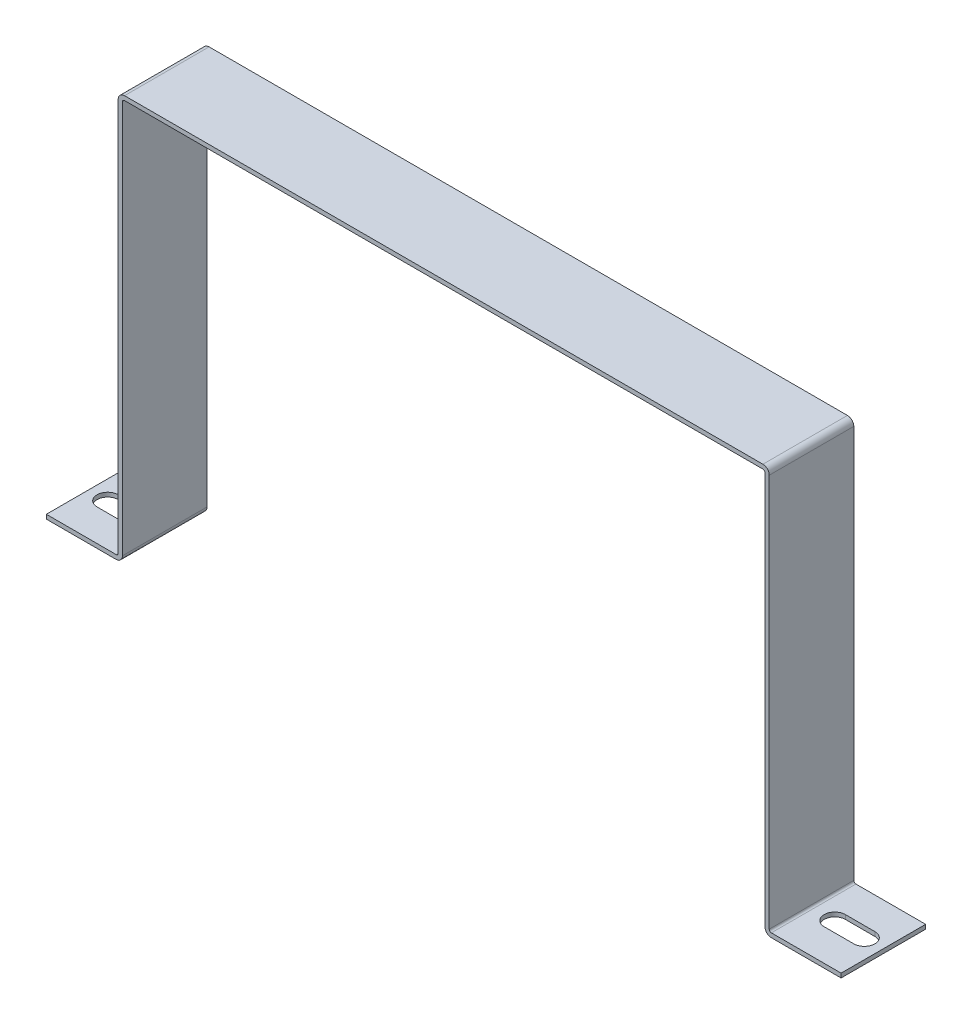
ISO-10303-21;
HEADER;
FILE_DESCRIPTION(('STEP AP214'),'2;1');
FILE_NAME('part.step','',(''),(''),'','','');
FILE_SCHEMA(('AUTOMOTIVE_DESIGN { 1 0 10303 214 1 1 1 1 }'));
ENDSEC;
DATA;
#1=APPLICATION_CONTEXT('core data for automotive mechanical design processes');
#2=APPLICATION_PROTOCOL_DEFINITION('international standard','automotive_design',2000,#1);
#3=PRODUCT_CONTEXT('',#1,'mechanical');
#4=PRODUCT('Part','Part','',(#3));
#5=PRODUCT_RELATED_PRODUCT_CATEGORY('part','',(#4));
#6=PRODUCT_DEFINITION_FORMATION('','',#4);
#7=PRODUCT_DEFINITION_CONTEXT('part definition',#1,'design');
#8=PRODUCT_DEFINITION('design','',#6,#7);
#9=PRODUCT_DEFINITION_SHAPE('','',#8);
#10=(LENGTH_UNIT() NAMED_UNIT(*) SI_UNIT(.MILLI.,.METRE.));
#11=(NAMED_UNIT(*) PLANE_ANGLE_UNIT() SI_UNIT($,.RADIAN.));
#12=(NAMED_UNIT(*) SI_UNIT($,.STERADIAN.) SOLID_ANGLE_UNIT());
#13=UNCERTAINTY_MEASURE_WITH_UNIT(LENGTH_MEASURE(1.E-05),#10,'distance_accuracy_value','');
#14=(GEOMETRIC_REPRESENTATION_CONTEXT(3) GLOBAL_UNCERTAINTY_ASSIGNED_CONTEXT((#13)) GLOBAL_UNIT_ASSIGNED_CONTEXT((#10,
#11,#12)) REPRESENTATION_CONTEXT('',''));
#15=CARTESIAN_POINT('',(0.,0.,0.));
#16=DIRECTION('',(0.,0.,1.));
#17=DIRECTION('',(1.,0.,0.));
#18=AXIS2_PLACEMENT_3D('',#15,#16,#17);
#19=CARTESIAN_POINT('',(-94.,0.999999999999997,20.));
#20=DIRECTION('',(1.,0.,0.));
#21=DIRECTION('',(0.,0.,-1.));
#22=AXIS2_PLACEMENT_3D('',#19,#20,#21);
#23=PLANE('',#22);
#24=DIRECTION('',(0.,-1.,0.));
#25=VECTOR('',#24,1.);
#26=CARTESIAN_POINT('',(-94.,0.999999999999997,0.));
#27=LINE('',#26,#25);
#28=CARTESIAN_POINT('',(-94.,0.999999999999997,0.));
#29=VERTEX_POINT('',#28);
#30=CARTESIAN_POINT('',(-94.,0.,0.));
#31=VERTEX_POINT('',#30);
#32=EDGE_CURVE('E261',#29,#31,#27,.T.);
#33=ORIENTED_EDGE('',*,*,#32,.T.);
#34=DIRECTION('',(0.,0.,-1.));
#35=VECTOR('',#34,1.);
#36=CARTESIAN_POINT('',(-94.,0.,20.));
#37=LINE('',#36,#35);
#38=CARTESIAN_POINT('',(-94.,0.,20.));
#39=VERTEX_POINT('',#38);
#40=EDGE_CURVE('E408',#39,#31,#37,.T.);
#41=ORIENTED_EDGE('',*,*,#40,.F.);
#42=DIRECTION('',(0.,-1.,0.));
#43=VECTOR('',#42,1.);
#44=CARTESIAN_POINT('',(-94.,0.999999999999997,20.));
#45=LINE('',#44,#43);
#46=CARTESIAN_POINT('',(-94.,0.999999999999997,20.));
#47=VERTEX_POINT('',#46);
#48=EDGE_CURVE('E309',#47,#39,#45,.T.);
#49=ORIENTED_EDGE('',*,*,#48,.F.);
#50=DIRECTION('',(0.,0.,-1.));
#51=VECTOR('',#50,1.);
#52=CARTESIAN_POINT('',(-94.,0.999999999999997,20.));
#53=LINE('',#52,#51);
#54=EDGE_CURVE('E350',#47,#29,#53,.T.);
#55=ORIENTED_EDGE('',*,*,#54,.T.);
#56=EDGE_LOOP('',(#33,#41,#49,#55));
#57=FACE_BOUND('',#56,.T.);
#58=ADVANCED_FACE('F35',(#57),#23,.F.);
#59=CARTESIAN_POINT('',(-77.5,0.,20.));
#60=DIRECTION('',(0.,1.,0.));
#61=DIRECTION('',(-1.,0.,0.));
#62=AXIS2_PLACEMENT_3D('',#59,#60,#61);
#63=PLANE('',#62);
#64=DIRECTION('',(1.,0.,0.));
#65=VECTOR('',#64,1.);
#66=CARTESIAN_POINT('',(-89.5,0.,7.5));
#67=LINE('',#66,#65);
#68=CARTESIAN_POINT('',(-89.5,0.,7.5));
#69=VERTEX_POINT('',#68);
#70=CARTESIAN_POINT('',(-82.5,0.,7.5));
#71=VERTEX_POINT('',#70);
#72=EDGE_CURVE('E249',#69,#71,#67,.T.);
#73=ORIENTED_EDGE('',*,*,#72,.F.);
#74=CARTESIAN_POINT('',(-89.5,0.,10.));
#75=DIRECTION('',(0.,-1.,0.));
#76=DIRECTION('',(1.,0.,0.));
#77=AXIS2_PLACEMENT_3D('',#74,#75,#76);
#78=CIRCLE('',#77,2.5);
#79=CARTESIAN_POINT('',(-89.5,0.,12.5));
#80=VERTEX_POINT('',#79);
#81=EDGE_CURVE('E245',#80,#69,#78,.T.);
#82=ORIENTED_EDGE('',*,*,#81,.F.);
#83=DIRECTION('',(-1.,0.,0.));
#84=VECTOR('',#83,1.);
#85=CARTESIAN_POINT('',(-89.5,0.,12.5));
#86=LINE('',#85,#84);
#87=CARTESIAN_POINT('',(-82.5,0.,12.5));
#88=VERTEX_POINT('',#87);
#89=EDGE_CURVE('E255',#88,#80,#86,.T.);
#90=ORIENTED_EDGE('',*,*,#89,.F.);
#91=CARTESIAN_POINT('',(-82.5,0.,10.));
#92=DIRECTION('',(0.,-1.,0.));
#93=DIRECTION('',(1.,0.,0.));
#94=AXIS2_PLACEMENT_3D('',#91,#92,#93);
#95=CIRCLE('',#94,2.5);
#96=EDGE_CURVE('E252',#71,#88,#95,.T.);
#97=ORIENTED_EDGE('',*,*,#96,.F.);
#98=EDGE_LOOP('',(#73,#82,#90,#97));
#99=FACE_BOUND('',#98,.T.);
#100=DIRECTION('',(1.,0.,0.));
#101=VECTOR('',#100,1.);
#102=CARTESIAN_POINT('',(-77.5,0.,0.));
#103=LINE('',#102,#101);
#104=CARTESIAN_POINT('',(-77.5,0.,0.));
#105=VERTEX_POINT('',#104);
#106=EDGE_CURVE('E270',#31,#105,#103,.T.);
#107=ORIENTED_EDGE('',*,*,#106,.T.);
#108=DIRECTION('',(0.,0.,-1.));
#109=VECTOR('',#108,1.);
#110=CARTESIAN_POINT('',(-77.5,0.,20.));
#111=LINE('',#110,#109);
#112=CARTESIAN_POINT('',(-77.5,0.,20.));
#113=VERTEX_POINT('',#112);
#114=EDGE_CURVE('E405',#113,#105,#111,.T.);
#115=ORIENTED_EDGE('',*,*,#114,.F.);
#116=DIRECTION('',(1.,0.,0.));
#117=VECTOR('',#116,1.);
#118=CARTESIAN_POINT('',(-77.5,0.,20.));
#119=LINE('',#118,#117);
#120=EDGE_CURVE('E312',#39,#113,#119,.T.);
#121=ORIENTED_EDGE('',*,*,#120,.F.);
#122=ORIENTED_EDGE('',*,*,#40,.T.);
#123=EDGE_LOOP('',(#107,#115,#121,#122));
#124=FACE_BOUND('',#123,.T.);
#125=ADVANCED_FACE('F447',(#99,#124),#63,.F.);
#126=CARTESIAN_POINT('',(-77.5,1.5,20.));
#127=DIRECTION('',(0.,0.,-1.));
#128=DIRECTION('',(-1.,0.,0.));
#129=AXIS2_PLACEMENT_3D('',#126,#127,#128);
#130=CYLINDRICAL_SURFACE('',#129,1.5);
#131=CARTESIAN_POINT('',(-77.5,1.5,0.));
#132=DIRECTION('',(0.,0.,1.));
#133=DIRECTION('',(-1.,0.,0.));
#134=AXIS2_PLACEMENT_3D('',#131,#132,#133);
#135=CIRCLE('',#134,1.5);
#136=CARTESIAN_POINT('',(-76.,1.50000000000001,0.));
#137=VERTEX_POINT('',#136);
#138=EDGE_CURVE('E272',#105,#137,#135,.T.);
#139=ORIENTED_EDGE('',*,*,#138,.T.);
#140=DIRECTION('',(0.,0.,-1.));
#141=VECTOR('',#140,1.);
#142=CARTESIAN_POINT('',(-76.,1.50000000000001,20.));
#143=LINE('',#142,#141);
#144=CARTESIAN_POINT('',(-76.,1.50000000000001,20.));
#145=VERTEX_POINT('',#144);
#146=EDGE_CURVE('E402',#145,#137,#143,.T.);
#147=ORIENTED_EDGE('',*,*,#146,.F.);
#148=CARTESIAN_POINT('',(-77.5,1.5,20.));
#149=DIRECTION('',(0.,0.,1.));
#150=DIRECTION('',(-1.,0.,0.));
#151=AXIS2_PLACEMENT_3D('',#148,#149,#150);
#152=CIRCLE('',#151,1.5);
#153=EDGE_CURVE('E314',#113,#145,#152,.T.);
#154=ORIENTED_EDGE('',*,*,#153,.F.);
#155=ORIENTED_EDGE('',*,*,#114,.T.);
#156=EDGE_LOOP('',(#139,#147,#154,#155));
#157=FACE_BOUND('',#156,.T.);
#158=ADVANCED_FACE('F452',(#157),#130,.T.);
#159=CARTESIAN_POINT('',(-76.,94.5,20.));
#160=DIRECTION('',(-1.,0.,0.));
#161=DIRECTION('',(0.,-1.,0.));
#162=AXIS2_PLACEMENT_3D('',#159,#160,#161);
#163=PLANE('',#162);
#164=DIRECTION('',(0.,1.,0.));
#165=VECTOR('',#164,1.);
#166=CARTESIAN_POINT('',(-76.,94.5,0.));
#167=LINE('',#166,#165);
#168=CARTESIAN_POINT('',(-76.,94.5,0.));
#169=VERTEX_POINT('',#168);
#170=EDGE_CURVE('E274',#137,#169,#167,.T.);
#171=ORIENTED_EDGE('',*,*,#170,.T.);
#172=DIRECTION('',(0.,0.,-1.));
#173=VECTOR('',#172,1.);
#174=CARTESIAN_POINT('',(-76.,94.5,20.));
#175=LINE('',#174,#173);
#176=CARTESIAN_POINT('',(-76.,94.5,20.));
#177=VERTEX_POINT('',#176);
#178=EDGE_CURVE('E399',#177,#169,#175,.T.);
#179=ORIENTED_EDGE('',*,*,#178,.F.);
#180=DIRECTION('',(0.,1.,0.));
#181=VECTOR('',#180,1.);
#182=CARTESIAN_POINT('',(-76.,94.5,20.));
#183=LINE('',#182,#181);
#184=EDGE_CURVE('E316',#145,#177,#183,.T.);
#185=ORIENTED_EDGE('',*,*,#184,.F.);
#186=ORIENTED_EDGE('',*,*,#146,.T.);
#187=EDGE_LOOP('',(#171,#179,#185,#186));
#188=FACE_BOUND('',#187,.T.);
#189=ADVANCED_FACE('F545',(#188),#163,.F.);
#190=CARTESIAN_POINT('',(-75.5,94.5,20.));
#191=DIRECTION('',(0.,0.,-1.));
#192=DIRECTION('',(-1.,0.,0.));
#193=AXIS2_PLACEMENT_3D('',#190,#191,#192);
#194=CYLINDRICAL_SURFACE('',#193,0.5);
#195=CARTESIAN_POINT('',(-75.5,94.5,0.));
#196=DIRECTION('',(0.,0.,-1.));
#197=DIRECTION('',(1.,0.,0.));
#198=AXIS2_PLACEMENT_3D('',#195,#196,#197);
#199=CIRCLE('',#198,0.5);
#200=CARTESIAN_POINT('',(-75.5,95.,0.));
#201=VERTEX_POINT('',#200);
#202=EDGE_CURVE('E277',#169,#201,#199,.T.);
#203=ORIENTED_EDGE('',*,*,#202,.T.);
#204=DIRECTION('',(0.,0.,-1.));
#205=VECTOR('',#204,1.);
#206=CARTESIAN_POINT('',(-75.5,95.,20.));
#207=LINE('',#206,#205);
#208=CARTESIAN_POINT('',(-75.5,95.,20.));
#209=VERTEX_POINT('',#208);
#210=EDGE_CURVE('E396',#209,#201,#207,.T.);
#211=ORIENTED_EDGE('',*,*,#210,.F.);
#212=CARTESIAN_POINT('',(-75.5,94.5,20.));
#213=DIRECTION('',(0.,0.,-1.));
#214=DIRECTION('',(1.,0.,0.));
#215=AXIS2_PLACEMENT_3D('',#212,#213,#214);
#216=CIRCLE('',#215,0.5);
#217=EDGE_CURVE('E318',#177,#209,#216,.T.);
#218=ORIENTED_EDGE('',*,*,#217,.F.);
#219=ORIENTED_EDGE('',*,*,#178,.T.);
#220=EDGE_LOOP('',(#203,#211,#218,#219));
#221=FACE_BOUND('',#220,.T.);
#222=ADVANCED_FACE('F541',(#221),#194,.F.);
#223=CARTESIAN_POINT('',(75.5,95.,20.));
#224=DIRECTION('',(0.,1.,0.));
#225=DIRECTION('',(0.,0.,1.));
#226=AXIS2_PLACEMENT_3D('',#223,#224,#225);
#227=PLANE('',#226);
#228=DIRECTION('',(1.,0.,0.));
#229=VECTOR('',#228,1.);
#230=CARTESIAN_POINT('',(75.5,95.,0.));
#231=LINE('',#230,#229);
#232=CARTESIAN_POINT('',(75.5,95.,0.));
#233=VERTEX_POINT('',#232);
#234=EDGE_CURVE('E279',#201,#233,#231,.T.);
#235=ORIENTED_EDGE('',*,*,#234,.T.);
#236=DIRECTION('',(0.,0.,-1.));
#237=VECTOR('',#236,1.);
#238=CARTESIAN_POINT('',(75.5,95.,20.));
#239=LINE('',#238,#237);
#240=CARTESIAN_POINT('',(75.5,95.,20.));
#241=VERTEX_POINT('',#240);
#242=EDGE_CURVE('E393',#241,#233,#239,.T.);
#243=ORIENTED_EDGE('',*,*,#242,.F.);
#244=DIRECTION('',(1.,0.,0.));
#245=VECTOR('',#244,1.);
#246=CARTESIAN_POINT('',(75.5,95.,20.));
#247=LINE('',#246,#245);
#248=EDGE_CURVE('E320',#209,#241,#247,.T.);
#249=ORIENTED_EDGE('',*,*,#248,.F.);
#250=ORIENTED_EDGE('',*,*,#210,.T.);
#251=EDGE_LOOP('',(#235,#243,#249,#250));
#252=FACE_BOUND('',#251,.T.);
#253=ADVANCED_FACE('F536',(#252),#227,.F.);
#254=CARTESIAN_POINT('',(75.5,94.5,20.));
#255=DIRECTION('',(0.,0.,-1.));
#256=DIRECTION('',(-1.,0.,0.));
#257=AXIS2_PLACEMENT_3D('',#254,#255,#256);
#258=CYLINDRICAL_SURFACE('',#257,0.499999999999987);
#259=CARTESIAN_POINT('',(75.5,94.5,0.));
#260=DIRECTION('',(0.,0.,-1.));
#261=DIRECTION('',(-1.,0.,0.));
#262=AXIS2_PLACEMENT_3D('',#259,#260,#261);
#263=CIRCLE('',#262,0.499999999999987);
#264=CARTESIAN_POINT('',(76.,94.5,0.));
#265=VERTEX_POINT('',#264);
#266=EDGE_CURVE('E281',#233,#265,#263,.T.);
#267=ORIENTED_EDGE('',*,*,#266,.T.);
#268=DIRECTION('',(0.,0.,-1.));
#269=VECTOR('',#268,1.);
#270=CARTESIAN_POINT('',(76.,94.5,20.));
#271=LINE('',#270,#269);
#272=CARTESIAN_POINT('',(76.,94.5,20.));
#273=VERTEX_POINT('',#272);
#274=EDGE_CURVE('E390',#273,#265,#271,.T.);
#275=ORIENTED_EDGE('',*,*,#274,.F.);
#276=CARTESIAN_POINT('',(75.5,94.5,20.));
#277=DIRECTION('',(0.,0.,-1.));
#278=DIRECTION('',(-1.,0.,0.));
#279=AXIS2_PLACEMENT_3D('',#276,#277,#278);
#280=CIRCLE('',#279,0.499999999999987);
#281=EDGE_CURVE('E322',#241,#273,#280,.T.);
#282=ORIENTED_EDGE('',*,*,#281,.F.);
#283=ORIENTED_EDGE('',*,*,#242,.T.);
#284=EDGE_LOOP('',(#267,#275,#282,#283));
#285=FACE_BOUND('',#284,.T.);
#286=ADVANCED_FACE('F531',(#285),#258,.F.);
#287=CARTESIAN_POINT('',(76.,94.5,20.));
#288=DIRECTION('',(1.,0.,0.));
#289=DIRECTION('',(0.,1.,0.));
#290=AXIS2_PLACEMENT_3D('',#287,#288,#289);
#291=PLANE('',#290);
#292=DIRECTION('',(0.,-1.,0.));
#293=VECTOR('',#292,1.);
#294=CARTESIAN_POINT('',(76.,94.5,0.));
#295=LINE('',#294,#293);
#296=CARTESIAN_POINT('',(76.,1.50000000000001,0.));
#297=VERTEX_POINT('',#296);
#298=EDGE_CURVE('E283',#265,#297,#295,.T.);
#299=ORIENTED_EDGE('',*,*,#298,.T.);
#300=DIRECTION('',(0.,0.,-1.));
#301=VECTOR('',#300,1.);
#302=CARTESIAN_POINT('',(76.,1.50000000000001,20.));
#303=LINE('',#302,#301);
#304=CARTESIAN_POINT('',(76.,1.50000000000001,20.));
#305=VERTEX_POINT('',#304);
#306=EDGE_CURVE('E387',#305,#297,#303,.T.);
#307=ORIENTED_EDGE('',*,*,#306,.F.);
#308=DIRECTION('',(0.,-1.,0.));
#309=VECTOR('',#308,1.);
#310=CARTESIAN_POINT('',(76.,94.5,20.));
#311=LINE('',#310,#309);
#312=EDGE_CURVE('E324',#273,#305,#311,.T.);
#313=ORIENTED_EDGE('',*,*,#312,.F.);
#314=ORIENTED_EDGE('',*,*,#274,.T.);
#315=EDGE_LOOP('',(#299,#307,#313,#314));
#316=FACE_BOUND('',#315,.T.);
#317=ADVANCED_FACE('F527',(#316),#291,.F.);
#318=CARTESIAN_POINT('',(77.5,1.5,20.));
#319=DIRECTION('',(0.,0.,-1.));
#320=DIRECTION('',(-1.,0.,0.));
#321=AXIS2_PLACEMENT_3D('',#318,#319,#320);
#322=CYLINDRICAL_SURFACE('',#321,1.5);
#323=CARTESIAN_POINT('',(77.5,1.5,0.));
#324=DIRECTION('',(0.,0.,1.));
#325=DIRECTION('',(1.,0.,0.));
#326=AXIS2_PLACEMENT_3D('',#323,#324,#325);
#327=CIRCLE('',#326,1.5);
#328=CARTESIAN_POINT('',(77.5,0.,0.));
#329=VERTEX_POINT('',#328);
#330=EDGE_CURVE('E285',#297,#329,#327,.T.);
#331=ORIENTED_EDGE('',*,*,#330,.T.);
#332=DIRECTION('',(0.,0.,-1.));
#333=VECTOR('',#332,1.);
#334=CARTESIAN_POINT('',(77.5,0.,20.));
#335=LINE('',#334,#333);
#336=CARTESIAN_POINT('',(77.5,0.,20.));
#337=VERTEX_POINT('',#336);
#338=EDGE_CURVE('E384',#337,#329,#335,.T.);
#339=ORIENTED_EDGE('',*,*,#338,.F.);
#340=CARTESIAN_POINT('',(77.5,1.5,20.));
#341=DIRECTION('',(0.,0.,1.));
#342=DIRECTION('',(1.,0.,0.));
#343=AXIS2_PLACEMENT_3D('',#340,#341,#342);
#344=CIRCLE('',#343,1.5);
#345=EDGE_CURVE('E326',#305,#337,#344,.T.);
#346=ORIENTED_EDGE('',*,*,#345,.F.);
#347=ORIENTED_EDGE('',*,*,#306,.T.);
#348=EDGE_LOOP('',(#331,#339,#346,#347));
#349=FACE_BOUND('',#348,.T.);
#350=ADVANCED_FACE('F522',(#349),#322,.T.);
#351=CARTESIAN_POINT('',(77.5,0.,20.));
#352=DIRECTION('',(0.,1.,0.));
#353=DIRECTION('',(-1.,0.,0.));
#354=AXIS2_PLACEMENT_3D('',#351,#352,#353);
#355=PLANE('',#354);
#356=DIRECTION('',(1.,0.,0.));
#357=VECTOR('',#356,1.);
#358=CARTESIAN_POINT('',(89.5,0.,7.5));
#359=LINE('',#358,#357);
#360=CARTESIAN_POINT('',(82.5,0.,7.5));
#361=VERTEX_POINT('',#360);
#362=CARTESIAN_POINT('',(89.5,0.,7.5));
#363=VERTEX_POINT('',#362);
#364=EDGE_CURVE('E231',#361,#363,#359,.T.);
#365=ORIENTED_EDGE('',*,*,#364,.F.);
#366=CARTESIAN_POINT('',(82.5,0.,10.));
#367=DIRECTION('',(0.,-1.,0.));
#368=DIRECTION('',(-1.,0.,0.));
#369=AXIS2_PLACEMENT_3D('',#366,#367,#368);
#370=CIRCLE('',#369,2.5);
#371=CARTESIAN_POINT('',(82.5,0.,12.5));
#372=VERTEX_POINT('',#371);
#373=EDGE_CURVE('E49',#372,#361,#370,.T.);
#374=ORIENTED_EDGE('',*,*,#373,.F.);
#375=DIRECTION('',(-1.,0.,0.));
#376=VECTOR('',#375,1.);
#377=CARTESIAN_POINT('',(89.5,0.,12.5));
#378=LINE('',#377,#376);
#379=CARTESIAN_POINT('',(89.5,0.,12.5));
#380=VERTEX_POINT('',#379);
#381=EDGE_CURVE('E238',#380,#372,#378,.T.);
#382=ORIENTED_EDGE('',*,*,#381,.F.);
#383=CARTESIAN_POINT('',(89.5,0.,10.));
#384=DIRECTION('',(0.,-1.,0.));
#385=DIRECTION('',(-1.,0.,0.));
#386=AXIS2_PLACEMENT_3D('',#383,#384,#385);
#387=CIRCLE('',#386,2.5);
#388=EDGE_CURVE('E222',#363,#380,#387,.T.);
#389=ORIENTED_EDGE('',*,*,#388,.F.);
#390=EDGE_LOOP('',(#365,#374,#382,#389));
#391=FACE_BOUND('',#390,.T.);
#392=DIRECTION('',(1.,0.,0.));
#393=VECTOR('',#392,1.);
#394=CARTESIAN_POINT('',(77.5,0.,0.));
#395=LINE('',#394,#393);
#396=CARTESIAN_POINT('',(94.,0.,0.));
#397=VERTEX_POINT('',#396);
#398=EDGE_CURVE('E287',#329,#397,#395,.T.);
#399=ORIENTED_EDGE('',*,*,#398,.T.);
#400=DIRECTION('',(0.,0.,-1.));
#401=VECTOR('',#400,1.);
#402=CARTESIAN_POINT('',(94.,0.,20.));
#403=LINE('',#402,#401);
#404=CARTESIAN_POINT('',(94.,0.,20.));
#405=VERTEX_POINT('',#404);
#406=EDGE_CURVE('E381',#405,#397,#403,.T.);
#407=ORIENTED_EDGE('',*,*,#406,.F.);
#408=DIRECTION('',(1.,0.,0.));
#409=VECTOR('',#408,1.);
#410=CARTESIAN_POINT('',(77.5,0.,20.));
#411=LINE('',#410,#409);
#412=EDGE_CURVE('E328',#337,#405,#411,.T.);
#413=ORIENTED_EDGE('',*,*,#412,.F.);
#414=ORIENTED_EDGE('',*,*,#338,.T.);
#415=EDGE_LOOP('',(#399,#407,#413,#414));
#416=FACE_BOUND('',#415,.T.);
#417=ADVANCED_FACE('F235',(#391,#416),#355,.F.);
#418=CARTESIAN_POINT('',(94.,0.999999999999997,20.));
#419=DIRECTION('',(-1.,0.,0.));
#420=DIRECTION('',(0.,0.,1.));
#421=AXIS2_PLACEMENT_3D('',#418,#419,#420);
#422=PLANE('',#421);
#423=DIRECTION('',(0.,1.,0.));
#424=VECTOR('',#423,1.);
#425=CARTESIAN_POINT('',(94.,0.999999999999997,0.));
#426=LINE('',#425,#424);
#427=CARTESIAN_POINT('',(94.,0.999999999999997,0.));
#428=VERTEX_POINT('',#427);
#429=EDGE_CURVE('E289',#397,#428,#426,.T.);
#430=ORIENTED_EDGE('',*,*,#429,.T.);
#431=DIRECTION('',(0.,0.,-1.));
#432=VECTOR('',#431,1.);
#433=CARTESIAN_POINT('',(94.,0.999999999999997,20.));
#434=LINE('',#433,#432);
#435=CARTESIAN_POINT('',(94.,0.999999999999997,20.));
#436=VERTEX_POINT('',#435);
#437=EDGE_CURVE('E378',#436,#428,#434,.T.);
#438=ORIENTED_EDGE('',*,*,#437,.F.);
#439=DIRECTION('',(0.,1.,0.));
#440=VECTOR('',#439,1.);
#441=CARTESIAN_POINT('',(94.,0.999999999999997,20.));
#442=LINE('',#441,#440);
#443=EDGE_CURVE('E330',#405,#436,#442,.T.);
#444=ORIENTED_EDGE('',*,*,#443,.F.);
#445=ORIENTED_EDGE('',*,*,#406,.T.);
#446=EDGE_LOOP('',(#430,#438,#444,#445));
#447=FACE_BOUND('',#446,.T.);
#448=ADVANCED_FACE('F514',(#447),#422,.F.);
#449=CARTESIAN_POINT('',(77.5,0.999999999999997,20.));
#450=DIRECTION('',(0.,-1.,0.));
#451=DIRECTION('',(0.,0.,-1.));
#452=AXIS2_PLACEMENT_3D('',#449,#450,#451);
#453=PLANE('',#452);
#454=DIRECTION('',(-1.,0.,0.));
#455=VECTOR('',#454,1.);
#456=CARTESIAN_POINT('',(77.5,0.999999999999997,12.5));
#457=LINE('',#456,#455);
#458=CARTESIAN_POINT('',(89.5,1.00000000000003,12.5));
#459=VERTEX_POINT('',#458);
#460=CARTESIAN_POINT('',(82.5,1.00000000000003,12.5));
#461=VERTEX_POINT('',#460);
#462=EDGE_CURVE('E42',#459,#461,#457,.T.);
#463=ORIENTED_EDGE('',*,*,#462,.T.);
#464=CARTESIAN_POINT('',(82.5,1.,10.));
#465=DIRECTION('',(0.,-1.,0.));
#466=DIRECTION('',(0.,0.,-1.));
#467=AXIS2_PLACEMENT_3D('',#464,#465,#466);
#468=CIRCLE('',#467,2.5);
#469=CARTESIAN_POINT('',(82.5,1.00000000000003,7.5));
#470=VERTEX_POINT('',#469);
#471=EDGE_CURVE('E11',#461,#470,#468,.T.);
#472=ORIENTED_EDGE('',*,*,#471,.T.);
#473=DIRECTION('',(1.,0.,0.));
#474=VECTOR('',#473,1.);
#475=CARTESIAN_POINT('',(77.5,0.999999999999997,7.5));
#476=LINE('',#475,#474);
#477=CARTESIAN_POINT('',(89.5,0.999999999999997,7.5));
#478=VERTEX_POINT('',#477);
#479=EDGE_CURVE('E423',#470,#478,#476,.T.);
#480=ORIENTED_EDGE('',*,*,#479,.T.);
#481=CARTESIAN_POINT('',(89.5,1.,10.));
#482=DIRECTION('',(0.,-1.,0.));
#483=DIRECTION('',(0.,0.,-1.));
#484=AXIS2_PLACEMENT_3D('',#481,#482,#483);
#485=CIRCLE('',#484,2.5);
#486=EDGE_CURVE('E225',#478,#459,#485,.T.);
#487=ORIENTED_EDGE('',*,*,#486,.T.);
#488=EDGE_LOOP('',(#463,#472,#480,#487));
#489=FACE_BOUND('',#488,.T.);
#490=DIRECTION('',(-1.,0.,0.));
#491=VECTOR('',#490,1.);
#492=CARTESIAN_POINT('',(77.5,0.999999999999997,0.));
#493=LINE('',#492,#491);
#494=CARTESIAN_POINT('',(77.5,0.999999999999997,0.));
#495=VERTEX_POINT('',#494);
#496=EDGE_CURVE('E291',#428,#495,#493,.T.);
#497=ORIENTED_EDGE('',*,*,#496,.T.);
#498=DIRECTION('',(0.,0.,-1.));
#499=VECTOR('',#498,1.);
#500=CARTESIAN_POINT('',(77.5,0.999999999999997,20.));
#501=LINE('',#500,#499);
#502=CARTESIAN_POINT('',(77.5,0.999999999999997,20.));
#503=VERTEX_POINT('',#502);
#504=EDGE_CURVE('E375',#503,#495,#501,.T.);
#505=ORIENTED_EDGE('',*,*,#504,.F.);
#506=DIRECTION('',(-1.,0.,0.));
#507=VECTOR('',#506,1.);
#508=CARTESIAN_POINT('',(77.5,0.999999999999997,20.));
#509=LINE('',#508,#507);
#510=EDGE_CURVE('E332',#436,#503,#509,.T.);
#511=ORIENTED_EDGE('',*,*,#510,.F.);
#512=ORIENTED_EDGE('',*,*,#437,.T.);
#513=EDGE_LOOP('',(#497,#505,#511,#512));
#514=FACE_BOUND('',#513,.T.);
#515=ADVANCED_FACE('F427',(#489,#514),#453,.F.);
#516=CARTESIAN_POINT('',(77.5,1.5,20.));
#517=DIRECTION('',(0.,0.,-1.));
#518=DIRECTION('',(-1.,0.,0.));
#519=AXIS2_PLACEMENT_3D('',#516,#517,#518);
#520=CYLINDRICAL_SURFACE('',#519,0.499999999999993);
#521=CARTESIAN_POINT('',(77.5,1.5,0.));
#522=DIRECTION('',(0.,0.,-1.));
#523=DIRECTION('',(1.,0.,0.));
#524=AXIS2_PLACEMENT_3D('',#521,#522,#523);
#525=CIRCLE('',#524,0.499999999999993);
#526=CARTESIAN_POINT('',(77.,1.5,0.));
#527=VERTEX_POINT('',#526);
#528=EDGE_CURVE('E293',#495,#527,#525,.T.);
#529=ORIENTED_EDGE('',*,*,#528,.T.);
#530=DIRECTION('',(0.,0.,-1.));
#531=VECTOR('',#530,1.);
#532=CARTESIAN_POINT('',(77.,1.5,20.));
#533=LINE('',#532,#531);
#534=CARTESIAN_POINT('',(77.,1.5,20.));
#535=VERTEX_POINT('',#534);
#536=EDGE_CURVE('E372',#535,#527,#533,.T.);
#537=ORIENTED_EDGE('',*,*,#536,.F.);
#538=CARTESIAN_POINT('',(77.5,1.5,20.));
#539=DIRECTION('',(0.,0.,-1.));
#540=DIRECTION('',(1.,0.,0.));
#541=AXIS2_PLACEMENT_3D('',#538,#539,#540);
#542=CIRCLE('',#541,0.499999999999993);
#543=EDGE_CURVE('E334',#503,#535,#542,.T.);
#544=ORIENTED_EDGE('',*,*,#543,.F.);
#545=ORIENTED_EDGE('',*,*,#504,.T.);
#546=EDGE_LOOP('',(#529,#537,#544,#545));
#547=FACE_BOUND('',#546,.T.);
#548=ADVANCED_FACE('F505',(#547),#520,.F.);
#549=CARTESIAN_POINT('',(77.,94.5,20.));
#550=DIRECTION('',(-1.,0.,0.));
#551=DIRECTION('',(0.,0.,1.));
#552=AXIS2_PLACEMENT_3D('',#549,#550,#551);
#553=PLANE('',#552);
#554=DIRECTION('',(0.,1.,0.));
#555=VECTOR('',#554,1.);
#556=CARTESIAN_POINT('',(77.,94.5,0.));
#557=LINE('',#556,#555);
#558=CARTESIAN_POINT('',(77.,94.5,0.));
#559=VERTEX_POINT('',#558);
#560=EDGE_CURVE('E295',#527,#559,#557,.T.);
#561=ORIENTED_EDGE('',*,*,#560,.T.);
#562=DIRECTION('',(0.,0.,-1.));
#563=VECTOR('',#562,1.);
#564=CARTESIAN_POINT('',(77.,94.5,20.));
#565=LINE('',#564,#563);
#566=CARTESIAN_POINT('',(77.,94.5,20.));
#567=VERTEX_POINT('',#566);
#568=EDGE_CURVE('E369',#567,#559,#565,.T.);
#569=ORIENTED_EDGE('',*,*,#568,.F.);
#570=DIRECTION('',(0.,1.,0.));
#571=VECTOR('',#570,1.);
#572=CARTESIAN_POINT('',(77.,94.5,20.));
#573=LINE('',#572,#571);
#574=EDGE_CURVE('E336',#535,#567,#573,.T.);
#575=ORIENTED_EDGE('',*,*,#574,.F.);
#576=ORIENTED_EDGE('',*,*,#536,.T.);
#577=EDGE_LOOP('',(#561,#569,#575,#576));
#578=FACE_BOUND('',#577,.T.);
#579=ADVANCED_FACE('F501',(#578),#553,.F.);
#580=CARTESIAN_POINT('',(75.5,94.5,20.));
#581=DIRECTION('',(0.,0.,-1.));
#582=DIRECTION('',(-1.,0.,0.));
#583=AXIS2_PLACEMENT_3D('',#580,#581,#582);
#584=CYLINDRICAL_SURFACE('',#583,1.5);
#585=CARTESIAN_POINT('',(75.5,94.5,0.));
#586=DIRECTION('',(0.,0.,1.));
#587=DIRECTION('',(-1.,0.,0.));
#588=AXIS2_PLACEMENT_3D('',#585,#586,#587);
#589=CIRCLE('',#588,1.5);
#590=CARTESIAN_POINT('',(75.5,96.,0.));
#591=VERTEX_POINT('',#590);
#592=EDGE_CURVE('E297',#559,#591,#589,.T.);
#593=ORIENTED_EDGE('',*,*,#592,.T.);
#594=DIRECTION('',(0.,0.,-1.));
#595=VECTOR('',#594,1.);
#596=CARTESIAN_POINT('',(75.5,96.,20.));
#597=LINE('',#596,#595);
#598=CARTESIAN_POINT('',(75.5,96.,20.));
#599=VERTEX_POINT('',#598);
#600=EDGE_CURVE('E366',#599,#591,#597,.T.);
#601=ORIENTED_EDGE('',*,*,#600,.F.);
#602=CARTESIAN_POINT('',(75.5,94.5,20.));
#603=DIRECTION('',(0.,0.,1.));
#604=DIRECTION('',(-1.,0.,0.));
#605=AXIS2_PLACEMENT_3D('',#602,#603,#604);
#606=CIRCLE('',#605,1.5);
#607=EDGE_CURVE('E338',#567,#599,#606,.T.);
#608=ORIENTED_EDGE('',*,*,#607,.F.);
#609=ORIENTED_EDGE('',*,*,#568,.T.);
#610=EDGE_LOOP('',(#593,#601,#608,#609));
#611=FACE_BOUND('',#610,.T.);
#612=ADVANCED_FACE('F496',(#611),#584,.T.);
#613=CARTESIAN_POINT('',(75.5,96.,20.));
#614=DIRECTION('',(0.,-1.,0.));
#615=DIRECTION('',(0.,0.,-1.));
#616=AXIS2_PLACEMENT_3D('',#613,#614,#615);
#617=PLANE('',#616);
#618=DIRECTION('',(-1.,0.,0.));
#619=VECTOR('',#618,1.);
#620=CARTESIAN_POINT('',(75.5,96.,0.));
#621=LINE('',#620,#619);
#622=CARTESIAN_POINT('',(-75.5,96.,0.));
#623=VERTEX_POINT('',#622);
#624=EDGE_CURVE('E299',#591,#623,#621,.T.);
#625=ORIENTED_EDGE('',*,*,#624,.T.);
#626=DIRECTION('',(0.,0.,-1.));
#627=VECTOR('',#626,1.);
#628=CARTESIAN_POINT('',(-75.5,96.,20.));
#629=LINE('',#628,#627);
#630=CARTESIAN_POINT('',(-75.5,96.,20.));
#631=VERTEX_POINT('',#630);
#632=EDGE_CURVE('E363',#631,#623,#629,.T.);
#633=ORIENTED_EDGE('',*,*,#632,.F.);
#634=DIRECTION('',(-1.,0.,0.));
#635=VECTOR('',#634,1.);
#636=CARTESIAN_POINT('',(75.5,96.,20.));
#637=LINE('',#636,#635);
#638=EDGE_CURVE('E340',#599,#631,#637,.T.);
#639=ORIENTED_EDGE('',*,*,#638,.F.);
#640=ORIENTED_EDGE('',*,*,#600,.T.);
#641=EDGE_LOOP('',(#625,#633,#639,#640));
#642=FACE_BOUND('',#641,.T.);
#643=ADVANCED_FACE('F490',(#642),#617,.F.);
#644=CARTESIAN_POINT('',(-75.5,94.5,20.));
#645=DIRECTION('',(0.,0.,-1.));
#646=DIRECTION('',(-1.,0.,0.));
#647=AXIS2_PLACEMENT_3D('',#644,#645,#646);
#648=CYLINDRICAL_SURFACE('',#647,1.5);
#649=CARTESIAN_POINT('',(-75.5,94.5,0.));
#650=DIRECTION('',(0.,0.,1.));
#651=DIRECTION('',(1.,0.,0.));
#652=AXIS2_PLACEMENT_3D('',#649,#650,#651);
#653=CIRCLE('',#652,1.5);
#654=CARTESIAN_POINT('',(-77.,94.5,0.));
#655=VERTEX_POINT('',#654);
#656=EDGE_CURVE('E301',#623,#655,#653,.T.);
#657=ORIENTED_EDGE('',*,*,#656,.T.);
#658=DIRECTION('',(0.,0.,-1.));
#659=VECTOR('',#658,1.);
#660=CARTESIAN_POINT('',(-77.,94.5,20.));
#661=LINE('',#660,#659);
#662=CARTESIAN_POINT('',(-77.,94.5,20.));
#663=VERTEX_POINT('',#662);
#664=EDGE_CURVE('E360',#663,#655,#661,.T.);
#665=ORIENTED_EDGE('',*,*,#664,.F.);
#666=CARTESIAN_POINT('',(-75.5,94.5,20.));
#667=DIRECTION('',(0.,0.,1.));
#668=DIRECTION('',(1.,0.,0.));
#669=AXIS2_PLACEMENT_3D('',#666,#667,#668);
#670=CIRCLE('',#669,1.5);
#671=EDGE_CURVE('E342',#631,#663,#670,.T.);
#672=ORIENTED_EDGE('',*,*,#671,.F.);
#673=ORIENTED_EDGE('',*,*,#632,.T.);
#674=EDGE_LOOP('',(#657,#665,#672,#673));
#675=FACE_BOUND('',#674,.T.);
#676=ADVANCED_FACE('F486',(#675),#648,.T.);
#677=CARTESIAN_POINT('',(-77.,94.5,20.));
#678=DIRECTION('',(1.,0.,0.));
#679=DIRECTION('',(0.,0.,-1.));
#680=AXIS2_PLACEMENT_3D('',#677,#678,#679);
#681=PLANE('',#680);
#682=DIRECTION('',(0.,-1.,0.));
#683=VECTOR('',#682,1.);
#684=CARTESIAN_POINT('',(-77.,94.5,0.));
#685=LINE('',#684,#683);
#686=CARTESIAN_POINT('',(-77.,1.5,0.));
#687=VERTEX_POINT('',#686);
#688=EDGE_CURVE('E303',#655,#687,#685,.T.);
#689=ORIENTED_EDGE('',*,*,#688,.T.);
#690=DIRECTION('',(0.,0.,-1.));
#691=VECTOR('',#690,1.);
#692=CARTESIAN_POINT('',(-77.,1.5,20.));
#693=LINE('',#692,#691);
#694=CARTESIAN_POINT('',(-77.,1.5,20.));
#695=VERTEX_POINT('',#694);
#696=EDGE_CURVE('E357',#695,#687,#693,.T.);
#697=ORIENTED_EDGE('',*,*,#696,.F.);
#698=DIRECTION('',(0.,-1.,0.));
#699=VECTOR('',#698,1.);
#700=CARTESIAN_POINT('',(-77.,94.5,20.));
#701=LINE('',#700,#699);
#702=EDGE_CURVE('E344',#663,#695,#701,.T.);
#703=ORIENTED_EDGE('',*,*,#702,.F.);
#704=ORIENTED_EDGE('',*,*,#664,.T.);
#705=EDGE_LOOP('',(#689,#697,#703,#704));
#706=FACE_BOUND('',#705,.T.);
#707=ADVANCED_FACE('F481',(#706),#681,.F.);
#708=CARTESIAN_POINT('',(-77.5,1.5,20.));
#709=DIRECTION('',(0.,0.,-1.));
#710=DIRECTION('',(-1.,0.,0.));
#711=AXIS2_PLACEMENT_3D('',#708,#709,#710);
#712=CYLINDRICAL_SURFACE('',#711,0.5);
#713=CARTESIAN_POINT('',(-77.5,1.5,0.));
#714=DIRECTION('',(0.,0.,-1.));
#715=DIRECTION('',(-1.,0.,0.));
#716=AXIS2_PLACEMENT_3D('',#713,#714,#715);
#717=CIRCLE('',#716,0.5);
#718=CARTESIAN_POINT('',(-77.5,0.999999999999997,0.));
#719=VERTEX_POINT('',#718);
#720=EDGE_CURVE('E305',#687,#719,#717,.T.);
#721=ORIENTED_EDGE('',*,*,#720,.T.);
#722=DIRECTION('',(0.,0.,-1.));
#723=VECTOR('',#722,1.);
#724=CARTESIAN_POINT('',(-77.5,0.999999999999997,20.));
#725=LINE('',#724,#723);
#726=CARTESIAN_POINT('',(-77.5,0.999999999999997,20.));
#727=VERTEX_POINT('',#726);
#728=EDGE_CURVE('E354',#727,#719,#725,.T.);
#729=ORIENTED_EDGE('',*,*,#728,.F.);
#730=CARTESIAN_POINT('',(-77.5,1.5,20.));
#731=DIRECTION('',(0.,0.,-1.));
#732=DIRECTION('',(-1.,0.,0.));
#733=AXIS2_PLACEMENT_3D('',#730,#731,#732);
#734=CIRCLE('',#733,0.5);
#735=EDGE_CURVE('E346',#695,#727,#734,.T.);
#736=ORIENTED_EDGE('',*,*,#735,.F.);
#737=ORIENTED_EDGE('',*,*,#696,.T.);
#738=EDGE_LOOP('',(#721,#729,#736,#737));
#739=FACE_BOUND('',#738,.T.);
#740=ADVANCED_FACE('F475',(#739),#712,.F.);
#741=CARTESIAN_POINT('',(-77.5,0.999999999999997,20.));
#742=DIRECTION('',(0.,-1.,0.));
#743=DIRECTION('',(0.,0.,-1.));
#744=AXIS2_PLACEMENT_3D('',#741,#742,#743);
#745=PLANE('',#744);
#746=DIRECTION('',(-1.,0.,0.));
#747=VECTOR('',#746,1.);
#748=CARTESIAN_POINT('',(-77.5,0.999999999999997,12.5));
#749=LINE('',#748,#747);
#750=CARTESIAN_POINT('',(-82.5,1.00000000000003,12.5));
#751=VERTEX_POINT('',#750);
#752=CARTESIAN_POINT('',(-89.5,1.00000000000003,12.5));
#753=VERTEX_POINT('',#752);
#754=EDGE_CURVE('E417',#751,#753,#749,.T.);
#755=ORIENTED_EDGE('',*,*,#754,.T.);
#756=CARTESIAN_POINT('',(-89.5,1.,10.));
#757=DIRECTION('',(0.,-1.,0.));
#758=DIRECTION('',(0.,0.,-1.));
#759=AXIS2_PLACEMENT_3D('',#756,#757,#758);
#760=CIRCLE('',#759,2.5);
#761=CARTESIAN_POINT('',(-89.5,1.00000000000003,7.5));
#762=VERTEX_POINT('',#761);
#763=EDGE_CURVE('E420',#753,#762,#760,.T.);
#764=ORIENTED_EDGE('',*,*,#763,.T.);
#765=DIRECTION('',(1.,0.,0.));
#766=VECTOR('',#765,1.);
#767=CARTESIAN_POINT('',(-77.5,0.999999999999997,7.5));
#768=LINE('',#767,#766);
#769=CARTESIAN_POINT('',(-82.5,0.999999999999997,7.5));
#770=VERTEX_POINT('',#769);
#771=EDGE_CURVE('E411',#762,#770,#768,.T.);
#772=ORIENTED_EDGE('',*,*,#771,.T.);
#773=CARTESIAN_POINT('',(-82.5,1.,10.));
#774=DIRECTION('',(0.,-1.,0.));
#775=DIRECTION('',(0.,0.,-1.));
#776=AXIS2_PLACEMENT_3D('',#773,#774,#775);
#777=CIRCLE('',#776,2.5);
#778=EDGE_CURVE('E414',#770,#751,#777,.T.);
#779=ORIENTED_EDGE('',*,*,#778,.T.);
#780=EDGE_LOOP('',(#755,#764,#772,#779));
#781=FACE_BOUND('',#780,.T.);
#782=DIRECTION('',(-1.,0.,0.));
#783=VECTOR('',#782,1.);
#784=CARTESIAN_POINT('',(-77.5,0.999999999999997,0.));
#785=LINE('',#784,#783);
#786=EDGE_CURVE('E307',#719,#29,#785,.T.);
#787=ORIENTED_EDGE('',*,*,#786,.T.);
#788=ORIENTED_EDGE('',*,*,#54,.F.);
#789=DIRECTION('',(-1.,0.,0.));
#790=VECTOR('',#789,1.);
#791=CARTESIAN_POINT('',(-77.5,0.999999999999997,20.));
#792=LINE('',#791,#790);
#793=EDGE_CURVE('E348',#727,#47,#792,.T.);
#794=ORIENTED_EDGE('',*,*,#793,.F.);
#795=ORIENTED_EDGE('',*,*,#728,.T.);
#796=EDGE_LOOP('',(#787,#788,#794,#795));
#797=FACE_BOUND('',#796,.T.);
#798=ADVANCED_FACE('F473',(#781,#797),#745,.F.);
#799=CARTESIAN_POINT('',(-77.5,1.5,20.));
#800=DIRECTION('',(0.,0.,-1.));
#801=DIRECTION('',(-1.,0.,0.));
#802=AXIS2_PLACEMENT_3D('',#799,#800,#801);
#803=PLANE('',#802);
#804=ORIENTED_EDGE('',*,*,#48,.T.);
#805=ORIENTED_EDGE('',*,*,#120,.T.);
#806=ORIENTED_EDGE('',*,*,#153,.T.);
#807=ORIENTED_EDGE('',*,*,#184,.T.);
#808=ORIENTED_EDGE('',*,*,#217,.T.);
#809=ORIENTED_EDGE('',*,*,#248,.T.);
#810=ORIENTED_EDGE('',*,*,#281,.T.);
#811=ORIENTED_EDGE('',*,*,#312,.T.);
#812=ORIENTED_EDGE('',*,*,#345,.T.);
#813=ORIENTED_EDGE('',*,*,#412,.T.);
#814=ORIENTED_EDGE('',*,*,#443,.T.);
#815=ORIENTED_EDGE('',*,*,#510,.T.);
#816=ORIENTED_EDGE('',*,*,#543,.T.);
#817=ORIENTED_EDGE('',*,*,#574,.T.);
#818=ORIENTED_EDGE('',*,*,#607,.T.);
#819=ORIENTED_EDGE('',*,*,#638,.T.);
#820=ORIENTED_EDGE('',*,*,#671,.T.);
#821=ORIENTED_EDGE('',*,*,#702,.T.);
#822=ORIENTED_EDGE('',*,*,#735,.T.);
#823=ORIENTED_EDGE('',*,*,#793,.T.);
#824=EDGE_LOOP('',(#804,#805,#806,#807,#808,#809,#810,#811,#812,#813,#814,#815,#816,#817,#818,
#819,#820,#821,#822,#823));
#825=FACE_BOUND('',#824,.T.);
#826=ADVANCED_FACE('F468',(#825),#803,.F.);
#827=CARTESIAN_POINT('',(-77.5,1.5,0.));
#828=DIRECTION('',(0.,0.,-1.));
#829=DIRECTION('',(-1.,0.,0.));
#830=AXIS2_PLACEMENT_3D('',#827,#828,#829);
#831=PLANE('',#830);
#832=ORIENTED_EDGE('',*,*,#32,.F.);
#833=ORIENTED_EDGE('',*,*,#786,.F.);
#834=ORIENTED_EDGE('',*,*,#720,.F.);
#835=ORIENTED_EDGE('',*,*,#688,.F.);
#836=ORIENTED_EDGE('',*,*,#656,.F.);
#837=ORIENTED_EDGE('',*,*,#624,.F.);
#838=ORIENTED_EDGE('',*,*,#592,.F.);
#839=ORIENTED_EDGE('',*,*,#560,.F.);
#840=ORIENTED_EDGE('',*,*,#528,.F.);
#841=ORIENTED_EDGE('',*,*,#496,.F.);
#842=ORIENTED_EDGE('',*,*,#429,.F.);
#843=ORIENTED_EDGE('',*,*,#398,.F.);
#844=ORIENTED_EDGE('',*,*,#330,.F.);
#845=ORIENTED_EDGE('',*,*,#298,.F.);
#846=ORIENTED_EDGE('',*,*,#266,.F.);
#847=ORIENTED_EDGE('',*,*,#234,.F.);
#848=ORIENTED_EDGE('',*,*,#202,.F.);
#849=ORIENTED_EDGE('',*,*,#170,.F.);
#850=ORIENTED_EDGE('',*,*,#138,.F.);
#851=ORIENTED_EDGE('',*,*,#106,.F.);
#852=EDGE_LOOP('',(#832,#833,#834,#835,#836,#837,#838,#839,#840,#841,#842,#843,#844,#845,#846,
#847,#848,#849,#850,#851));
#853=FACE_BOUND('',#852,.T.);
#854=ADVANCED_FACE('F460',(#853),#831,.T.);
#855=CARTESIAN_POINT('',(-89.5,96.,10.));
#856=DIRECTION('',(0.,-1.,0.));
#857=DIRECTION('',(1.,0.,0.));
#858=AXIS2_PLACEMENT_3D('',#855,#856,#857);
#859=CYLINDRICAL_SURFACE('',#858,2.5);
#860=DIRECTION('',(0.,-1.,0.));
#861=VECTOR('',#860,1.);
#862=CARTESIAN_POINT('',(-89.5,96.,12.5));
#863=LINE('',#862,#861);
#864=EDGE_CURVE('E259',#753,#80,#863,.T.);
#865=ORIENTED_EDGE('',*,*,#864,.T.);
#866=ORIENTED_EDGE('',*,*,#81,.T.);
#867=DIRECTION('',(0.,-1.,0.));
#868=VECTOR('',#867,1.);
#869=CARTESIAN_POINT('',(-89.5,96.,7.5));
#870=LINE('',#869,#868);
#871=EDGE_CURVE('E258',#762,#69,#870,.T.);
#872=ORIENTED_EDGE('',*,*,#871,.F.);
#873=ORIENTED_EDGE('',*,*,#763,.F.);
#874=EDGE_LOOP('',(#865,#866,#872,#873));
#875=FACE_BOUND('',#874,.T.);
#876=ADVANCED_FACE('F592',(#875),#859,.F.);
#877=CARTESIAN_POINT('',(-89.5,96.,12.5));
#878=DIRECTION('',(0.,0.,1.));
#879=DIRECTION('',(1.,0.,0.));
#880=AXIS2_PLACEMENT_3D('',#877,#878,#879);
#881=PLANE('',#880);
#882=DIRECTION('',(0.,-1.,0.));
#883=VECTOR('',#882,1.);
#884=CARTESIAN_POINT('',(-82.5,96.,12.5));
#885=LINE('',#884,#883);
#886=EDGE_CURVE('E262',#751,#88,#885,.T.);
#887=ORIENTED_EDGE('',*,*,#886,.T.);
#888=ORIENTED_EDGE('',*,*,#89,.T.);
#889=ORIENTED_EDGE('',*,*,#864,.F.);
#890=ORIENTED_EDGE('',*,*,#754,.F.);
#891=EDGE_LOOP('',(#887,#888,#889,#890));
#892=FACE_BOUND('',#891,.T.);
#893=ADVANCED_FACE('F594',(#892),#881,.F.);
#894=CARTESIAN_POINT('',(-82.5,96.,10.));
#895=DIRECTION('',(0.,-1.,0.));
#896=DIRECTION('',(1.,0.,0.));
#897=AXIS2_PLACEMENT_3D('',#894,#895,#896);
#898=CYLINDRICAL_SURFACE('',#897,2.5);
#899=DIRECTION('',(0.,-1.,0.));
#900=VECTOR('',#899,1.);
#901=CARTESIAN_POINT('',(-82.5,96.,7.5));
#902=LINE('',#901,#900);
#903=EDGE_CURVE('E264',#770,#71,#902,.T.);
#904=ORIENTED_EDGE('',*,*,#903,.T.);
#905=ORIENTED_EDGE('',*,*,#96,.T.);
#906=ORIENTED_EDGE('',*,*,#886,.F.);
#907=ORIENTED_EDGE('',*,*,#778,.F.);
#908=EDGE_LOOP('',(#904,#905,#906,#907));
#909=FACE_BOUND('',#908,.T.);
#910=ADVANCED_FACE('F441',(#909),#898,.F.);
#911=CARTESIAN_POINT('',(-89.5,96.,7.5));
#912=DIRECTION('',(0.,0.,-1.));
#913=DIRECTION('',(-1.,0.,0.));
#914=AXIS2_PLACEMENT_3D('',#911,#912,#913);
#915=PLANE('',#914);
#916=ORIENTED_EDGE('',*,*,#871,.T.);
#917=ORIENTED_EDGE('',*,*,#72,.T.);
#918=ORIENTED_EDGE('',*,*,#903,.F.);
#919=ORIENTED_EDGE('',*,*,#771,.F.);
#920=EDGE_LOOP('',(#916,#917,#918,#919));
#921=FACE_BOUND('',#920,.T.);
#922=ADVANCED_FACE('F434',(#921),#915,.F.);
#923=CARTESIAN_POINT('',(82.5,96.,10.));
#924=DIRECTION('',(0.,-1.,0.));
#925=DIRECTION('',(1.,0.,0.));
#926=AXIS2_PLACEMENT_3D('',#923,#924,#925);
#927=CYLINDRICAL_SURFACE('',#926,2.5);
#928=DIRECTION('',(0.,-1.,0.));
#929=VECTOR('',#928,1.);
#930=CARTESIAN_POINT('',(82.5,96.,12.5));
#931=LINE('',#930,#929);
#932=EDGE_CURVE('E243',#461,#372,#931,.T.);
#933=ORIENTED_EDGE('',*,*,#932,.T.);
#934=ORIENTED_EDGE('',*,*,#373,.T.);
#935=DIRECTION('',(0.,-1.,0.));
#936=VECTOR('',#935,1.);
#937=CARTESIAN_POINT('',(82.5,96.,7.5));
#938=LINE('',#937,#936);
#939=EDGE_CURVE('E228',#470,#361,#938,.T.);
#940=ORIENTED_EDGE('',*,*,#939,.F.);
#941=ORIENTED_EDGE('',*,*,#471,.F.);
#942=EDGE_LOOP('',(#933,#934,#940,#941));
#943=FACE_BOUND('',#942,.T.);
#944=ADVANCED_FACE('F432',(#943),#927,.F.);
#945=CARTESIAN_POINT('',(89.5,96.,12.5));
#946=DIRECTION('',(0.,0.,1.));
#947=DIRECTION('',(1.,0.,0.));
#948=AXIS2_PLACEMENT_3D('',#945,#946,#947);
#949=PLANE('',#948);
#950=DIRECTION('',(0.,-1.,0.));
#951=VECTOR('',#950,1.);
#952=CARTESIAN_POINT('',(89.5,96.,12.5));
#953=LINE('',#952,#951);
#954=EDGE_CURVE('E227',#459,#380,#953,.T.);
#955=ORIENTED_EDGE('',*,*,#954,.T.);
#956=ORIENTED_EDGE('',*,*,#381,.T.);
#957=ORIENTED_EDGE('',*,*,#932,.F.);
#958=ORIENTED_EDGE('',*,*,#462,.F.);
#959=EDGE_LOOP('',(#955,#956,#957,#958));
#960=FACE_BOUND('',#959,.T.);
#961=ADVANCED_FACE('F431',(#960),#949,.F.);
#962=CARTESIAN_POINT('',(89.5,96.,10.));
#963=DIRECTION('',(0.,-1.,0.));
#964=DIRECTION('',(1.,0.,0.));
#965=AXIS2_PLACEMENT_3D('',#962,#963,#964);
#966=CYLINDRICAL_SURFACE('',#965,2.5);
#967=DIRECTION('',(0.,-1.,0.));
#968=VECTOR('',#967,1.);
#969=CARTESIAN_POINT('',(89.5,96.,7.5));
#970=LINE('',#969,#968);
#971=EDGE_CURVE('E57',#478,#363,#970,.T.);
#972=ORIENTED_EDGE('',*,*,#971,.T.);
#973=ORIENTED_EDGE('',*,*,#388,.T.);
#974=ORIENTED_EDGE('',*,*,#954,.F.);
#975=ORIENTED_EDGE('',*,*,#486,.F.);
#976=EDGE_LOOP('',(#972,#973,#974,#975));
#977=FACE_BOUND('',#976,.T.);
#978=ADVANCED_FACE('F219',(#977),#966,.F.);
#979=CARTESIAN_POINT('',(89.5,96.,7.5));
#980=DIRECTION('',(0.,0.,-1.));
#981=DIRECTION('',(-1.,0.,0.));
#982=AXIS2_PLACEMENT_3D('',#979,#980,#981);
#983=PLANE('',#982);
#984=ORIENTED_EDGE('',*,*,#939,.T.);
#985=ORIENTED_EDGE('',*,*,#364,.T.);
#986=ORIENTED_EDGE('',*,*,#971,.F.);
#987=ORIENTED_EDGE('',*,*,#479,.F.);
#988=EDGE_LOOP('',(#984,#985,#986,#987));
#989=FACE_BOUND('',#988,.T.);
#990=ADVANCED_FACE('F232',(#989),#983,.F.);
#991=CLOSED_SHELL('',(#58,#125,#158,#189,#222,#253,#286,#317,#350,#417,#448,#515,#548,#579,#612,
#643,#676,#707,#740,#798,#826,#854,#876,#893,#910,#922,#944,#961,#978,#990));
#992=MANIFOLD_SOLID_BREP('B2',#991);
#993=ADVANCED_BREP_SHAPE_REPRESENTATION('',(#18,#992),#14);
#994=SHAPE_DEFINITION_REPRESENTATION(#9,#993);
ENDSEC;
END-ISO-10303-21;
